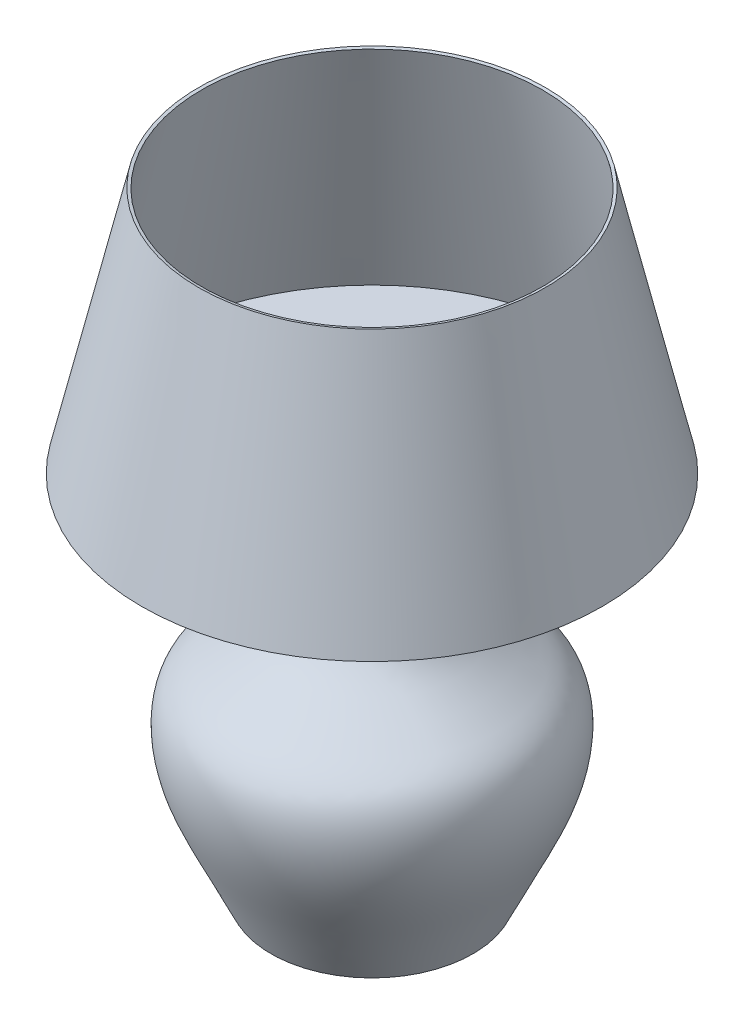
ISO-10303-21;
HEADER;
FILE_DESCRIPTION(('STEP AP214'),'2;1');
FILE_NAME('part.step','',(''),(''),'','','');
FILE_SCHEMA(('AUTOMOTIVE_DESIGN { 1 0 10303 214 1 1 1 1 }'));
ENDSEC;
DATA;
#1=APPLICATION_CONTEXT('core data for automotive mechanical design processes');
#2=APPLICATION_PROTOCOL_DEFINITION('international standard','automotive_design',2000,#1);
#3=PRODUCT_CONTEXT('',#1,'mechanical');
#4=PRODUCT('Part','Part','',(#3));
#5=PRODUCT_RELATED_PRODUCT_CATEGORY('part','',(#4));
#6=PRODUCT_DEFINITION_FORMATION('','',#4);
#7=PRODUCT_DEFINITION_CONTEXT('part definition',#1,'design');
#8=PRODUCT_DEFINITION('design','',#6,#7);
#9=PRODUCT_DEFINITION_SHAPE('','',#8);
#10=(LENGTH_UNIT() NAMED_UNIT(*) SI_UNIT(.MILLI.,.METRE.));
#11=(NAMED_UNIT(*) PLANE_ANGLE_UNIT() SI_UNIT($,.RADIAN.));
#12=(NAMED_UNIT(*) SI_UNIT($,.STERADIAN.) SOLID_ANGLE_UNIT());
#13=UNCERTAINTY_MEASURE_WITH_UNIT(LENGTH_MEASURE(1.E-05),#10,'distance_accuracy_value','');
#14=(GEOMETRIC_REPRESENTATION_CONTEXT(3) GLOBAL_UNCERTAINTY_ASSIGNED_CONTEXT((#13)) GLOBAL_UNIT_ASSIGNED_CONTEXT((#10,
#11,#12)) REPRESENTATION_CONTEXT('',''));
#15=CARTESIAN_POINT('',(0.,0.,0.));
#16=DIRECTION('',(0.,0.,1.));
#17=DIRECTION('',(1.,0.,0.));
#18=AXIS2_PLACEMENT_3D('',#15,#16,#17);
#19=CARTESIAN_POINT('',(1212.00782576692,735.468669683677,0.));
#20=DIRECTION('',(0.,-1.,0.));
#21=DIRECTION('',(0.,0.,-1.));
#22=AXIS2_PLACEMENT_3D('',#19,#20,#21);
#23=CONICAL_SURFACE('',#22,228.73167253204,0.226068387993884);
#24=CARTESIAN_POINT('',(1212.00782576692,981.796226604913,0.));
#25=DIRECTION('',(0.,-1.,0.));
#26=DIRECTION('',(0.,0.,-1.));
#27=AXIS2_PLACEMENT_3D('',#24,#25,#26);
#28=CIRCLE('',#27,172.076334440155);
#29=CARTESIAN_POINT('',(1212.00782576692,981.796226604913,-172.076334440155));
#30=VERTEX_POINT('',#29);
#31=EDGE_CURVE('E10',#30,#30,#28,.T.);
#32=ORIENTED_EDGE('',*,*,#31,.F.);
#33=EDGE_LOOP('',(#32));
#34=FACE_BOUND('',#33,.T.);
#35=CARTESIAN_POINT('',(1212.00782576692,735.468669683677,0.));
#36=DIRECTION('',(0.,-1.,0.));
#37=DIRECTION('',(0.,0.,-1.));
#38=AXIS2_PLACEMENT_3D('',#35,#36,#37);
#39=CIRCLE('',#38,228.73167253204);
#40=CARTESIAN_POINT('',(1212.00782576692,735.468669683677,-228.73167253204));
#41=VERTEX_POINT('',#40);
#42=EDGE_CURVE('E71',#41,#41,#39,.T.);
#43=ORIENTED_EDGE('',*,*,#42,.T.);
#44=EDGE_LOOP('',(#43));
#45=FACE_BOUND('',#44,.T.);
#46=ADVANCED_FACE('F31',(#34,#45),#23,.F.);
#47=CARTESIAN_POINT('',(1212.00782576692,982.468669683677,0.));
#48=DIRECTION('',(0.,1.,0.));
#49=DIRECTION('',(0.,0.,1.));
#50=AXIS2_PLACEMENT_3D('',#47,#48,#49);
#51=CONICAL_SURFACE('',#50,175.,1.34472793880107);
#52=ORIENTED_EDGE('',*,*,#31,.T.);
#53=EDGE_LOOP('',(#52));
#54=FACE_BOUND('',#53,.T.);
#55=CARTESIAN_POINT('',(1212.00782576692,982.468669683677,0.));
#56=DIRECTION('',(0.,-1.,0.));
#57=DIRECTION('',(0.,0.,-1.));
#58=AXIS2_PLACEMENT_3D('',#55,#56,#57);
#59=CIRCLE('',#58,175.);
#60=CARTESIAN_POINT('',(1212.00782576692,982.468669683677,-175.));
#61=VERTEX_POINT('',#60);
#62=EDGE_CURVE('E37',#61,#61,#59,.T.);
#63=ORIENTED_EDGE('',*,*,#62,.F.);
#64=EDGE_LOOP('',(#63));
#65=FACE_BOUND('',#64,.T.);
#66=ADVANCED_FACE('F118',(#54,#65),#51,.F.);
#67=CARTESIAN_POINT('',(1212.00782576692,732.468669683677,0.));
#68=DIRECTION('',(0.,-1.,0.));
#69=DIRECTION('',(0.,0.,-1.));
#70=AXIS2_PLACEMENT_3D('',#67,#68,#69);
#71=CONICAL_SURFACE('',#70,232.5,0.226068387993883);
#72=ORIENTED_EDGE('',*,*,#62,.T.);
#73=EDGE_LOOP('',(#72));
#74=FACE_BOUND('',#73,.T.);
#75=CARTESIAN_POINT('',(1212.00782576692,732.468669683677,0.));
#76=DIRECTION('',(0.,-1.,0.));
#77=DIRECTION('',(0.,0.,-1.));
#78=AXIS2_PLACEMENT_3D('',#75,#76,#77);
#79=CIRCLE('',#78,232.5);
#80=CARTESIAN_POINT('',(1212.00782576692,732.468669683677,-232.5));
#81=VERTEX_POINT('',#80);
#82=EDGE_CURVE('E41',#81,#81,#79,.T.);
#83=ORIENTED_EDGE('',*,*,#82,.F.);
#84=EDGE_LOOP('',(#83));
#85=FACE_BOUND('',#84,.T.);
#86=ADVANCED_FACE('F115',(#74,#85),#71,.T.);
#87=CARTESIAN_POINT('',(1204.50782576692,732.468669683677,0.));
#88=DIRECTION('',(0.,-1.,0.));
#89=DIRECTION('',(0.,0.,-1.));
#90=AXIS2_PLACEMENT_3D('',#87,#88,#89);
#91=PLANE('',#90);
#92=ORIENTED_EDGE('',*,*,#82,.T.);
#93=EDGE_LOOP('',(#92));
#94=FACE_BOUND('',#93,.T.);
#95=CARTESIAN_POINT('',(1212.00782576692,732.468669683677,0.));
#96=DIRECTION('',(0.,-1.,0.));
#97=DIRECTION('',(0.,0.,-1.));
#98=AXIS2_PLACEMENT_3D('',#95,#96,#97);
#99=CIRCLE('',#98,7.50000000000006);
#100=CARTESIAN_POINT('',(1212.00782576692,732.468669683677,-7.50000000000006));
#101=VERTEX_POINT('',#100);
#102=EDGE_CURVE('E45',#101,#101,#99,.T.);
#103=ORIENTED_EDGE('',*,*,#102,.F.);
#104=EDGE_LOOP('',(#103));
#105=FACE_BOUND('',#104,.T.);
#106=ADVANCED_FACE('F111',(#94,#105),#91,.T.);
#107=CARTESIAN_POINT('',(1212.00782576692,363.628778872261,0.));
#108=DIRECTION('',(0.,-1.,0.));
#109=DIRECTION('',(0.,0.,-1.));
#110=AXIS2_PLACEMENT_3D('',#107,#108,#109);
#111=CYLINDRICAL_SURFACE('',#110,7.50000000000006);
#112=ORIENTED_EDGE('',*,*,#102,.T.);
#113=EDGE_LOOP('',(#112));
#114=FACE_BOUND('',#113,.T.);
#115=CARTESIAN_POINT('',(1212.00782576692,692.468669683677,0.));
#116=DIRECTION('',(0.,-1.,0.));
#117=DIRECTION('',(0.,0.,-1.));
#118=AXIS2_PLACEMENT_3D('',#115,#116,#117);
#119=CIRCLE('',#118,7.50000000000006);
#120=CARTESIAN_POINT('',(1212.00782576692,692.468669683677,-7.50000000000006));
#121=VERTEX_POINT('',#120);
#122=EDGE_CURVE('E50',#121,#121,#119,.T.);
#123=ORIENTED_EDGE('',*,*,#122,.F.);
#124=EDGE_LOOP('',(#123));
#125=FACE_BOUND('',#124,.T.);
#126=ADVANCED_FACE('F107',(#114,#125),#111,.T.);
#127=CARTESIAN_POINT('',(1168.00782576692,692.468669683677,0.));
#128=DIRECTION('',(0.,1.,0.));
#129=DIRECTION('',(0.,0.,1.));
#130=AXIS2_PLACEMENT_3D('',#127,#128,#129);
#131=PLANE('',#130);
#132=ORIENTED_EDGE('',*,*,#122,.T.);
#133=EDGE_LOOP('',(#132));
#134=FACE_BOUND('',#133,.T.);
#135=CARTESIAN_POINT('',(1212.00782576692,692.468669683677,0.));
#136=DIRECTION('',(0.,-1.,0.));
#137=DIRECTION('',(0.,0.,-1.));
#138=AXIS2_PLACEMENT_3D('',#135,#136,#137);
#139=CIRCLE('',#138,44.);
#140=CARTESIAN_POINT('',(1212.00782576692,692.468669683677,-44.));
#141=VERTEX_POINT('',#140);
#142=EDGE_CURVE('E53',#141,#141,#139,.T.);
#143=ORIENTED_EDGE('',*,*,#142,.F.);
#144=EDGE_LOOP('',(#143));
#145=FACE_BOUND('',#144,.T.);
#146=ADVANCED_FACE('F103',(#134,#145),#131,.T.);
#147=CARTESIAN_POINT('',(1110.00782576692,363.628778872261,0.));
#148=CARTESIAN_POINT('',(1101.88891237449,380.440434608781,0.));
#149=CARTESIAN_POINT('',(1082.73165743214,421.522237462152,0.));
#150=CARTESIAN_POINT('',(1050.1033413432,486.270426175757,0.));
#151=CARTESIAN_POINT('',(1055.66126862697,553.808707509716,0.));
#152=CARTESIAN_POINT('',(1088.23347443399,572.290664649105,0.));
#153=CARTESIAN_POINT('',(1110.55238288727,587.452840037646,0.));
#154=CARTESIAN_POINT('',(1147.26748125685,610.671727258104,0.));
#155=CARTESIAN_POINT('',(1166.10106993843,640.986262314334,0.));
#156=CARTESIAN_POINT('',(1168.00782576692,692.468669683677,0.));
#157=B_SPLINE_CURVE_WITH_KNOTS('',3,(#147,#148,#149,#150,#151,#152,#153,#154,#155,#156),
.UNSPECIFIED.,.F.,.F.,(4,1,1,1,1,1,1,4),(0.,0.147743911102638,0.368082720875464,
0.519892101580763,0.62540742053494,0.646805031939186,0.733868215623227,1.),.UNSPECIFIED.);
#158=CARTESIAN_POINT('',(1212.00782576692,363.628778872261,0.));
#159=DIRECTION('',(0.,-1.,0.));
#160=AXIS1_PLACEMENT('',#158,#159);
#161=SURFACE_OF_REVOLUTION('',#157,#160);
#162=ORIENTED_EDGE('',*,*,#142,.T.);
#163=EDGE_LOOP('',(#162));
#164=FACE_BOUND('',#163,.T.);
#165=CARTESIAN_POINT('',(1212.00782576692,363.628778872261,0.));
#166=DIRECTION('',(0.,-1.,0.));
#167=DIRECTION('',(0.,0.,-1.));
#168=AXIS2_PLACEMENT_3D('',#165,#166,#167);
#169=CIRCLE('',#168,102.);
#170=CARTESIAN_POINT('',(1212.00782576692,363.628778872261,-102.));
#171=VERTEX_POINT('',#170);
#172=EDGE_CURVE('E56',#171,#171,#169,.T.);
#173=ORIENTED_EDGE('',*,*,#172,.F.);
#174=EDGE_LOOP('',(#173));
#175=FACE_BOUND('',#174,.T.);
#176=ADVANCED_FACE('F99',(#164,#175),#161,.F.);
#177=CARTESIAN_POINT('',(1212.00782576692,363.628778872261,0.));
#178=DIRECTION('',(0.,-1.,0.));
#179=DIRECTION('',(0.,0.,-1.));
#180=AXIS2_PLACEMENT_3D('',#177,#178,#179);
#181=PLANE('',#180);
#182=ORIENTED_EDGE('',*,*,#172,.T.);
#183=EDGE_LOOP('',(#182));
#184=FACE_BOUND('',#183,.T.);
#185=ADVANCED_FACE('F95',(#184),#181,.T.);
#186=CARTESIAN_POINT('',(1212.00782576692,366.628778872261,0.));
#187=DIRECTION('',(0.,-1.,0.));
#188=DIRECTION('',(0.,0.,-1.));
#189=AXIS2_PLACEMENT_3D('',#186,#187,#188);
#190=PLANE('',#189);
#191=CARTESIAN_POINT('',(1212.00782576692,366.628778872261,0.));
#192=DIRECTION('',(0.,-1.,0.));
#193=DIRECTION('',(0.,0.,-1.));
#194=AXIS2_PLACEMENT_3D('',#191,#192,#193);
#195=CIRCLE('',#194,100.116370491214);
#196=CARTESIAN_POINT('',(1212.00782576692,366.628778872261,-100.116370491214));
#197=VERTEX_POINT('',#196);
#198=EDGE_CURVE('E59',#197,#197,#195,.T.);
#199=ORIENTED_EDGE('',*,*,#198,.F.);
#200=EDGE_LOOP('',(#199));
#201=FACE_BOUND('',#200,.T.);
#202=ADVANCED_FACE('F90',(#201),#190,.F.);
#203=CARTESIAN_POINT('',(1111.89145527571,366.628778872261,0.));
#204=CARTESIAN_POINT('',(1105.12298189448,380.675016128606,0.));
#205=CARTESIAN_POINT('',(1098.62256608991,394.537771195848,0.));
#206=CARTESIAN_POINT('',(1090.90752114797,410.646412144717,0.));
#207=CARTESIAN_POINT('',(1090.04471367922,412.443372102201,0.));
#208=CARTESIAN_POINT('',(1088.30550183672,416.053988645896,0.));
#209=CARTESIAN_POINT('',(1087.42862472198,417.867339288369,0.));
#210=CARTESIAN_POINT('',(1084.78847143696,423.326751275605,0.));
#211=CARTESIAN_POINT('',(1083.015431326,426.9942445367,0.));
#212=CARTESIAN_POINT('',(1077.74911288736,438.084977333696,0.));
#213=CARTESIAN_POINT('',(1074.30884130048,445.59668466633,0.));
#214=CARTESIAN_POINT('',(1068.05419527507,460.873517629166,0.));
#215=CARTESIAN_POINT('',(1065.24000752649,468.638314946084,0.));
#216=CARTESIAN_POINT('',(1061.84506228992,480.486064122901,0.));
#217=CARTESIAN_POINT('',(1060.85104052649,484.468741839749,0.));
#218=CARTESIAN_POINT('',(1059.61013671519,490.494905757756,0.));
#219=CARTESIAN_POINT('',(1059.23818391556,492.512326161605,0.));
#220=CARTESIAN_POINT('',(1058.5848627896,496.565024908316,0.));
#221=CARTESIAN_POINT('',(1058.30332176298,498.601490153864,0.));
#222=CARTESIAN_POINT('',(1057.1427802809,508.811275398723,0.));
#223=CARTESIAN_POINT('',(1057.01123873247,517.050212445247,0.));
#224=CARTESIAN_POINT('',(1058.44697826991,528.680862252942,0.));
#225=CARTESIAN_POINT('',(1059.19699066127,532.436240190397,0.));
#226=CARTESIAN_POINT('',(1061.30170786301,539.571523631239,0.));
#227=CARTESIAN_POINT('',(1062.65598741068,542.95093500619,0.));
#228=CARTESIAN_POINT('',(1065.18441995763,547.65238281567,0.));
#229=CARTESIAN_POINT('',(1066.11007636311,549.158463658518,0.));
#230=CARTESIAN_POINT('',(1067.62943782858,551.317261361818,0.));
#231=CARTESIAN_POINT('',(1068.15721525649,552.018969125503,0.));
#232=CARTESIAN_POINT('',(1069.26204288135,553.396202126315,0.));
#233=CARTESIAN_POINT('',(1069.83839421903,554.071495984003,0.));
#234=CARTESIAN_POINT('',(1072.83133438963,557.387524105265,0.));
#235=CARTESIAN_POINT('',(1075.58352786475,559.847065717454,0.));
#236=CARTESIAN_POINT('',(1081.54853120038,564.524159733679,0.));
#237=CARTESIAN_POINT('',(1084.75998377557,566.74096756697,0.));
#238=CARTESIAN_POINT('',(1091.35870058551,571.091988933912,0.));
#239=CARTESIAN_POINT('',(1094.7455526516,573.226197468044,0.));
#240=CARTESIAN_POINT('',(1098.91174815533,575.957771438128,0.));
#241=CARTESIAN_POINT('',(1099.74001812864,576.507097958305,0.));
#242=CARTESIAN_POINT('',(1101.37905629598,577.601836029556,0.));
#243=CARTESIAN_POINT('',(1102.19117538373,578.147913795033,0.));
#244=CARTESIAN_POINT('',(1104.60786684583,579.774456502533,0.));
#245=CARTESIAN_POINT('',(1106.19105344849,580.837844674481,0.));
#246=CARTESIAN_POINT('',(1110.91593247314,583.981167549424,0.));
#247=CARTESIAN_POINT('',(1114.01611404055,586.019087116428,0.));
#248=CARTESIAN_POINT('',(1120.07350156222,590.083777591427,0.));
#249=CARTESIAN_POINT('',(1123.03076349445,592.110539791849,0.));
#250=CARTESIAN_POINT('',(1128.75652447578,596.259460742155,0.));
#251=CARTESIAN_POINT('',(1131.52461623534,598.384495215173,0.));
#252=CARTESIAN_POINT('',(1139.46902374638,605.037772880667,0.));
#253=CARTESIAN_POINT('',(1144.30015438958,609.841611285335,0.));
#254=CARTESIAN_POINT('',(1152.87398093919,620.773909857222,0.));
#255=CARTESIAN_POINT('',(1156.61254938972,626.900544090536,0.));
#256=CARTESIAN_POINT('',(1162.86004715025,640.99392780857,0.));
#257=CARTESIAN_POINT('',(1165.3704958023,648.957486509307,0.));
#258=CARTESIAN_POINT('',(1169.10400114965,667.270493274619,0.));
#259=CARTESIAN_POINT('',(1170.3288696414,677.621288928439,0.));
#260=CARTESIAN_POINT('',(1170.88464198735,689.468669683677,0.));
#261=B_SPLINE_CURVE_WITH_KNOTS('',3,(#203,#204,#205,#206,#207,#208,#209,#210,#211,#212,#213,
#214,#215,#216,#217,#218,#219,#220,#221,#222,#223,#224,#225,#226,#227,#228,#229,#230,#231,#232,
#233,#234,#235,#236,#237,#238,#239,#240,#241,#242,#243,#244,#245,#246,#247,#248,#249,#250,#251,
#252,#253,#254,#255,#256,#257,#258,#259,#260),.UNSPECIFIED.,.F.,.F.,(4,2,2,2,2,2,2,2,2,2,2,2,2,
2,2,2,2,2,2,2,2,2,2,2,2,2,2,2,4),(0.,0.124999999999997,0.140624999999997,0.156249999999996,
0.187499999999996,0.249999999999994,0.312499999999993,0.343749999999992,0.359374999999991,
0.374999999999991,0.43749999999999,0.46874999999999,0.499999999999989,0.515624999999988,
0.523437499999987,0.531249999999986,0.562499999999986,0.593749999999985,0.624999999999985,
0.632812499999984,0.640624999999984,0.656249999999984,0.687499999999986,0.718749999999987,
0.749999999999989,0.812499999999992,0.874999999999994,0.937499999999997,1.),.UNSPECIFIED.);
#262=CARTESIAN_POINT('',(1212.00782576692,363.628778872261,0.));
#263=DIRECTION('',(0.,-1.,0.));
#264=AXIS1_PLACEMENT('',#262,#263);
#265=SURFACE_OF_REVOLUTION('',#261,#264);
#266=CARTESIAN_POINT('',(1212.00782576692,689.468669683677,0.));
#267=DIRECTION('',(0.,-1.,0.));
#268=DIRECTION('',(0.,0.,-1.));
#269=AXIS2_PLACEMENT_3D('',#266,#267,#268);
#270=CIRCLE('',#269,41.12318377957);
#271=CARTESIAN_POINT('',(1212.00782576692,689.468669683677,-41.12318377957));
#272=VERTEX_POINT('',#271);
#273=EDGE_CURVE('E62',#272,#272,#270,.T.);
#274=ORIENTED_EDGE('',*,*,#273,.F.);
#275=EDGE_LOOP('',(#274));
#276=FACE_BOUND('',#275,.T.);
#277=ORIENTED_EDGE('',*,*,#198,.T.);
#278=EDGE_LOOP('',(#277));
#279=FACE_BOUND('',#278,.T.);
#280=ADVANCED_FACE('F85',(#276,#279),#265,.T.);
#281=CARTESIAN_POINT('',(1168.00782576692,689.468669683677,0.));
#282=DIRECTION('',(0.,1.,0.));
#283=DIRECTION('',(0.,0.,1.));
#284=AXIS2_PLACEMENT_3D('',#281,#282,#283);
#285=PLANE('',#284);
#286=CARTESIAN_POINT('',(1212.00782576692,689.468669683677,0.));
#287=DIRECTION('',(0.,-1.,0.));
#288=DIRECTION('',(0.,0.,-1.));
#289=AXIS2_PLACEMENT_3D('',#286,#287,#288);
#290=CIRCLE('',#289,4.50000000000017);
#291=CARTESIAN_POINT('',(1212.00782576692,689.468669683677,-4.50000000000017));
#292=VERTEX_POINT('',#291);
#293=EDGE_CURVE('E65',#292,#292,#290,.T.);
#294=ORIENTED_EDGE('',*,*,#293,.F.);
#295=EDGE_LOOP('',(#294));
#296=FACE_BOUND('',#295,.T.);
#297=ORIENTED_EDGE('',*,*,#273,.T.);
#298=EDGE_LOOP('',(#297));
#299=FACE_BOUND('',#298,.T.);
#300=ADVANCED_FACE('F89',(#296,#299),#285,.F.);
#301=CARTESIAN_POINT('',(1212.00782576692,363.628778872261,0.));
#302=DIRECTION('',(0.,-1.,0.));
#303=DIRECTION('',(0.,0.,-1.));
#304=AXIS2_PLACEMENT_3D('',#301,#302,#303);
#305=CYLINDRICAL_SURFACE('',#304,4.50000000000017);
#306=CARTESIAN_POINT('',(1212.00782576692,735.468669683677,0.));
#307=DIRECTION('',(0.,-1.,0.));
#308=DIRECTION('',(0.,0.,-1.));
#309=AXIS2_PLACEMENT_3D('',#306,#307,#308);
#310=CIRCLE('',#309,4.50000000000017);
#311=CARTESIAN_POINT('',(1212.00782576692,735.468669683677,-4.50000000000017));
#312=VERTEX_POINT('',#311);
#313=EDGE_CURVE('E68',#312,#312,#310,.T.);
#314=ORIENTED_EDGE('',*,*,#313,.F.);
#315=EDGE_LOOP('',(#314));
#316=FACE_BOUND('',#315,.T.);
#317=ORIENTED_EDGE('',*,*,#293,.T.);
#318=EDGE_LOOP('',(#317));
#319=FACE_BOUND('',#318,.T.);
#320=ADVANCED_FACE('F133',(#316,#319),#305,.F.);
#321=CARTESIAN_POINT('',(1204.50782576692,735.468669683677,0.));
#322=DIRECTION('',(0.,-1.,0.));
#323=DIRECTION('',(0.,0.,-1.));
#324=AXIS2_PLACEMENT_3D('',#321,#322,#323);
#325=PLANE('',#324);
#326=ORIENTED_EDGE('',*,*,#42,.F.);
#327=EDGE_LOOP('',(#326));
#328=FACE_BOUND('',#327,.T.);
#329=ORIENTED_EDGE('',*,*,#313,.T.);
#330=EDGE_LOOP('',(#329));
#331=FACE_BOUND('',#330,.T.);
#332=ADVANCED_FACE('F130',(#328,#331),#325,.F.);
#333=CLOSED_SHELL('',(#46,#66,#86,#106,#126,#146,#176,#185,#202,#280,#300,#320,#332));
#334=MANIFOLD_SOLID_BREP('B2',#333);
#335=ADVANCED_BREP_SHAPE_REPRESENTATION('',(#18,#334),#14);
#336=SHAPE_DEFINITION_REPRESENTATION(#9,#335);
ENDSEC;
END-ISO-10303-21;
